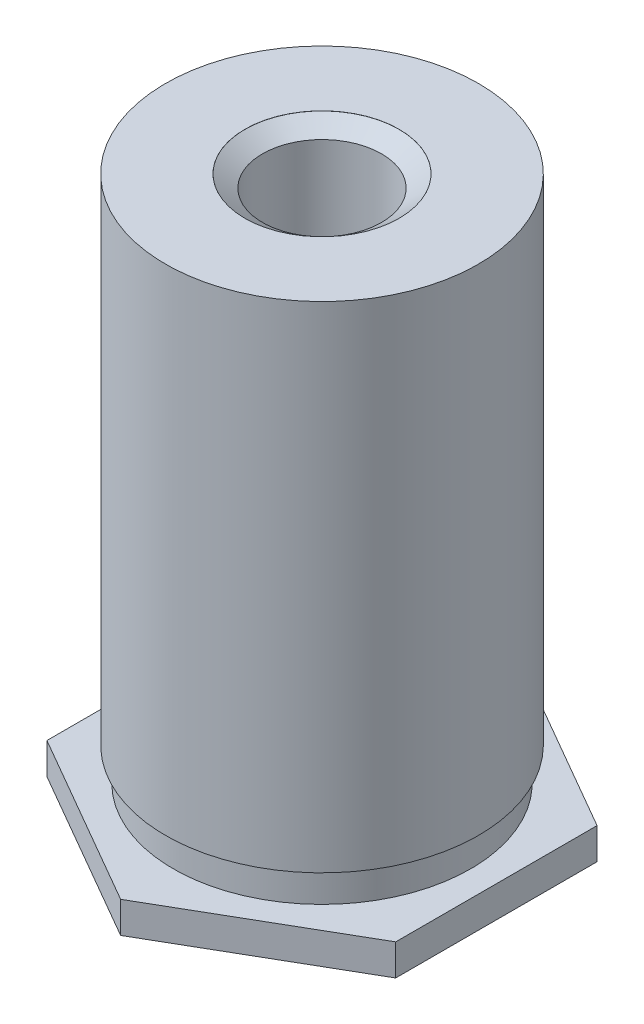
from build123d import *

# Parameters (mm, degrees)
HEXDIESKE_R  = 4.609084
HEXDIE_DEPTH = 0.7112


with BuildPart() as part:
    # BodySke → Body (revolve)
    with BuildSketch(Plane.XY, mode=Mode.PRIVATE) as body_sk:
        Polygon((3.556, 0), (4.596384, 0), (4.596384, 0.7112), (3.3782, 0.7112), (3.3782, 1.45796), (3.556, 1.45796), (3.556, 12.7), (1.35255, 12.7), (1.35255, 6.35), (0, 6.35), (0, 0.00254), (3.556, 0.00254), align=None)
    revolve(body_sk.sketch.rotate(Axis((0, 0, 0), (0, 1, 0)), 90), axis=Axis((0, 0, 0), (0, 1, 0)))

    # TapDriSke → TapDrill (revolve, cut)
    with BuildSketch(Plane.XY, mode=Mode.PRIVATE) as tapdrill_sk:
        Polygon((1.35255, 2.3876), (1.35255, 12.7), (0, 12.7), (0, 1.827355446), align=None)
    revolve(tapdrill_sk.sketch.rotate(Axis((0, 0, 0), (0, 1, 0)), 90), axis=Axis((0, 0, 0), (0, 1, 0)), mode=Mode.SUBTRACT)

    # EndChamferSke → EndChamfer (revolve, cut)
    with BuildSketch(Plane.XY, mode=Mode.PRIVATE) as endchamfer_sk:
        Polygon((1.7526, 12.69746), (1.35255, 12.417446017), (1.35255, 12.954), (1.7526, 12.954), align=None)
    revolve(endchamfer_sk.sketch.rotate(Axis((0, -2.54, 0), (0, 1, 0)), 90), axis=Axis((0, -2.54, 0), (0, 1, 0)), mode=Mode.SUBTRACT)

    # HexDieSke → HexDie (cut)
    with BuildSketch(Plane(origin=(0, 0.7112, 0), x_dir=(-1, 0, 0), z_dir=(0, 1, 0))):
        Circle(HEXDIESKE_R)
        Polygon((0, 4.575385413), (3.9624, 2.287692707), (3.9624, -2.287692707), (0, -4.575385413), (-3.9624, -2.287692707), (-3.9624, 2.287692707), align=None, mode=Mode.SUBTRACT)
    extrude(amount=-HEXDIE_DEPTH, mode=Mode.SUBTRACT)


solid = part.part
